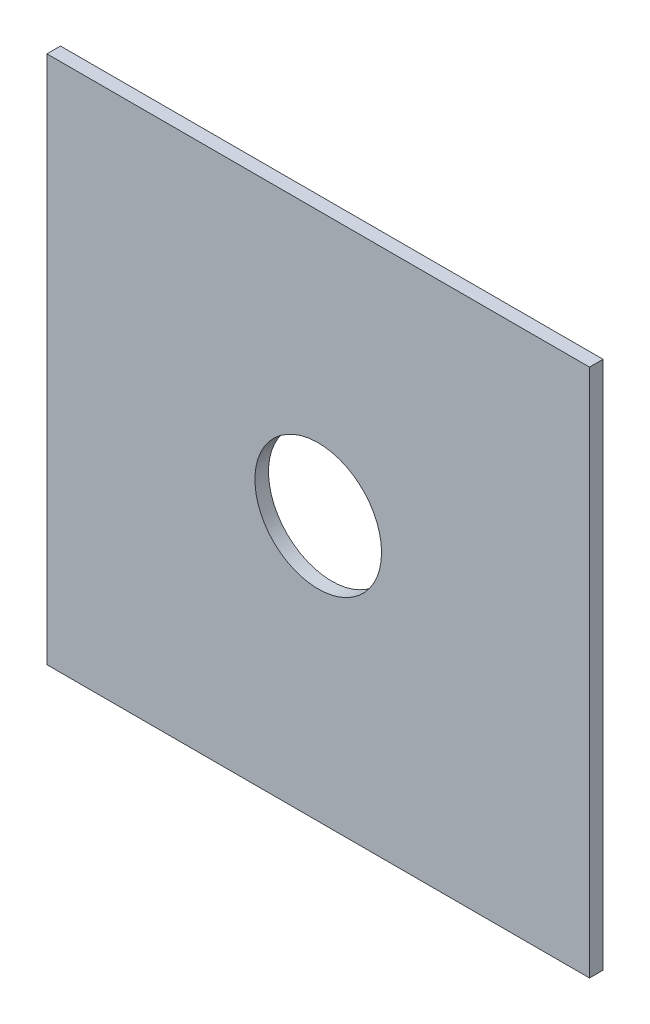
from build123d import *

# Parameters (mm, degrees)
CROQUIS1_W              = 600
CROQUIS1_H              = 585
SALIENTE_EXTRUIR1_DEPTH = 15
CROQUIS2_R              = 70
CORTAR_EXTRUIR1_DEPTH   = 15


with BuildPart() as part:
    # Croquis1 → Saliente-Extruir1 (new body)
    with BuildSketch(Plane.XY):
        Rectangle(CROQUIS1_W, CROQUIS1_H)
    extrude(amount=SALIENTE_EXTRUIR1_DEPTH)

    # Croquis2 → Cortar-Extruir1 (cut)
    with BuildSketch(Plane.XY.offset(15)):
        Circle(CROQUIS2_R)
    extrude(amount=-CORTAR_EXTRUIR1_DEPTH, mode=Mode.SUBTRACT)


solid = part.part
